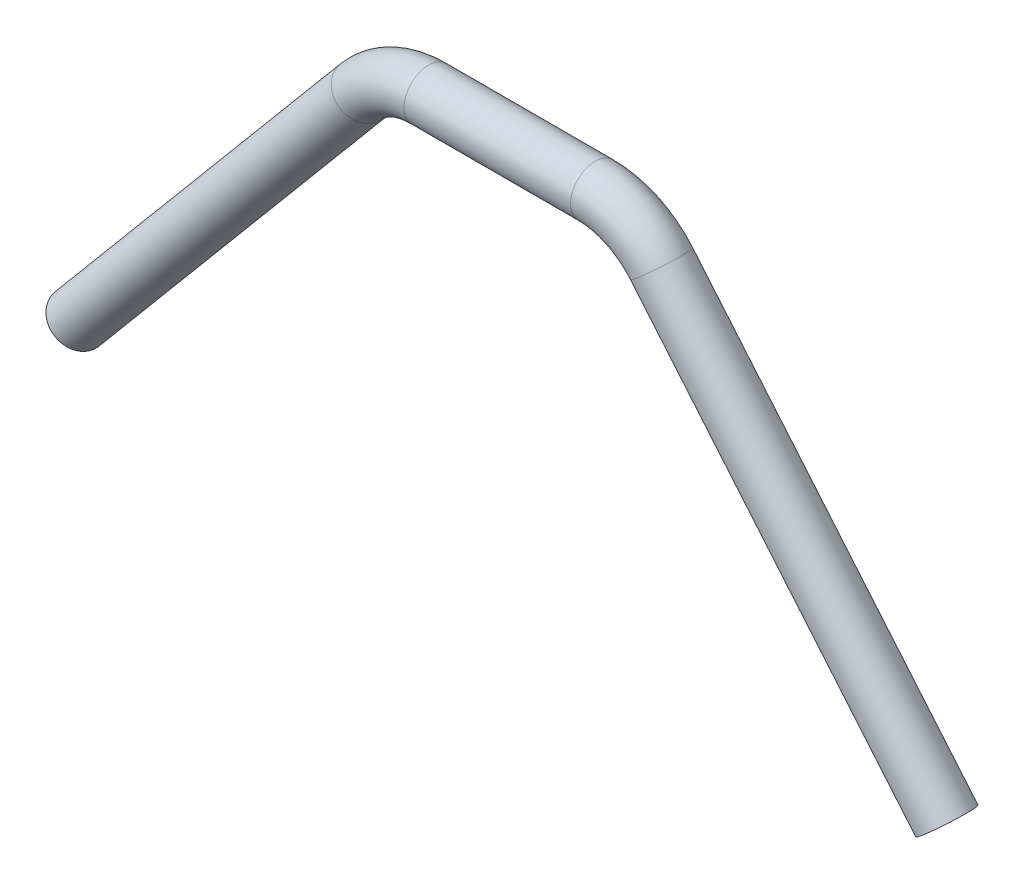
ISO-10303-21;
HEADER;
FILE_DESCRIPTION(('STEP AP214'),'2;1');
FILE_NAME('part.step','',(''),(''),'','','');
FILE_SCHEMA(('AUTOMOTIVE_DESIGN { 1 0 10303 214 1 1 1 1 }'));
ENDSEC;
DATA;
#1=APPLICATION_CONTEXT('core data for automotive mechanical design processes');
#2=APPLICATION_PROTOCOL_DEFINITION('international standard','automotive_design',2000,#1);
#3=PRODUCT_CONTEXT('',#1,'mechanical');
#4=PRODUCT('Part','Part','',(#3));
#5=PRODUCT_RELATED_PRODUCT_CATEGORY('part','',(#4));
#6=PRODUCT_DEFINITION_FORMATION('','',#4);
#7=PRODUCT_DEFINITION_CONTEXT('part definition',#1,'design');
#8=PRODUCT_DEFINITION('design','',#6,#7);
#9=PRODUCT_DEFINITION_SHAPE('','',#8);
#10=(LENGTH_UNIT() NAMED_UNIT(*) SI_UNIT(.MILLI.,.METRE.));
#11=(NAMED_UNIT(*) PLANE_ANGLE_UNIT() SI_UNIT($,.RADIAN.));
#12=(NAMED_UNIT(*) SI_UNIT($,.STERADIAN.) SOLID_ANGLE_UNIT());
#13=UNCERTAINTY_MEASURE_WITH_UNIT(LENGTH_MEASURE(1.E-05),#10,'distance_accuracy_value','');
#14=(GEOMETRIC_REPRESENTATION_CONTEXT(3) GLOBAL_UNCERTAINTY_ASSIGNED_CONTEXT((#13)) GLOBAL_UNIT_ASSIGNED_CONTEXT((#10,
#11,#12)) REPRESENTATION_CONTEXT('',''));
#15=CARTESIAN_POINT('',(0.,0.,0.));
#16=DIRECTION('',(0.,0.,1.));
#17=DIRECTION('',(1.,0.,0.));
#18=AXIS2_PLACEMENT_3D('',#15,#16,#17);
#19=CARTESIAN_POINT('',(-60.4907874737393,-12.5024336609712,0.));
#20=DIRECTION('',(-0.642787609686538,-0.766044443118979,0.));
#21=DIRECTION('',(0.766044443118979,-0.642787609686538,0.));
#22=AXIS2_PLACEMENT_3D('',#19,#20,#21);
#23=CYLINDRICAL_SURFACE('',#22,10.);
#24=CARTESIAN_POINT('',(-60.4907874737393,-12.5024336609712,0.));
#25=DIRECTION('',(0.642787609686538,0.766044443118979,0.));
#26=DIRECTION('',(0.,0.,-1.));
#27=AXIS2_PLACEMENT_3D('',#24,#25,#26);
#28=CIRCLE('',#27,10.);
#29=CARTESIAN_POINT('',(-68.1512319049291,-6.07455756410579,0.));
#30=VERTEX_POINT('',#29);
#31=EDGE_CURVE('E38',#30,#30,#28,.T.);
#32=ORIENTED_EDGE('',*,*,#31,.F.);
#33=EDGE_LOOP('',(#32));
#34=FACE_BOUND('',#33,.T.);
#35=CARTESIAN_POINT('',(-175.864944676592,-150.,0.));
#36=DIRECTION('',(0.642787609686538,0.766044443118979,0.));
#37=DIRECTION('',(0.,0.,-1.));
#38=AXIS2_PLACEMENT_3D('',#35,#36,#37);
#39=CIRCLE('',#38,10.);
#40=CARTESIAN_POINT('',(-175.864944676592,-150.,-10.));
#41=VERTEX_POINT('',#40);
#42=EDGE_CURVE('E10',#41,#41,#39,.T.);
#43=ORIENTED_EDGE('',*,*,#42,.T.);
#44=EDGE_LOOP('',(#43));
#45=FACE_BOUND('',#44,.T.);
#46=ADVANCED_FACE('F28',(#34,#45),#23,.T.);
#47=CARTESIAN_POINT('',(-60.4907874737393,-12.5024336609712,0.));
#48=DIRECTION('',(-0.642787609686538,-0.766044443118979,0.));
#49=DIRECTION('',(0.766044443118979,-0.642787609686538,0.));
#50=AXIS2_PLACEMENT_3D('',#47,#48,#49);
#51=CYLINDRICAL_SURFACE('',#50,8.5);
#52=CARTESIAN_POINT('',(-60.4907874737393,-12.5024336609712,0.));
#53=DIRECTION('',(0.642787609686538,0.766044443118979,0.));
#54=DIRECTION('',(0.,0.,-1.));
#55=AXIS2_PLACEMENT_3D('',#52,#53,#54);
#56=CIRCLE('',#55,8.5);
#57=CARTESIAN_POINT('',(-67.0021652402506,-7.0387389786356,0.));
#58=VERTEX_POINT('',#57);
#59=EDGE_CURVE('E42',#58,#58,#56,.T.);
#60=ORIENTED_EDGE('',*,*,#59,.T.);
#61=EDGE_LOOP('',(#60));
#62=FACE_BOUND('',#61,.T.);
#63=CARTESIAN_POINT('',(-175.864944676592,-150.,0.));
#64=DIRECTION('',(0.642787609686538,0.766044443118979,0.));
#65=DIRECTION('',(0.,0.,-1.));
#66=AXIS2_PLACEMENT_3D('',#63,#64,#65);
#67=CIRCLE('',#66,8.5);
#68=CARTESIAN_POINT('',(-175.864944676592,-150.,-8.5));
#69=VERTEX_POINT('',#68);
#70=EDGE_CURVE('E34',#69,#69,#67,.T.);
#71=ORIENTED_EDGE('',*,*,#70,.F.);
#72=EDGE_LOOP('',(#71));
#73=FACE_BOUND('',#72,.T.);
#74=ADVANCED_FACE('F104',(#62,#73),#51,.F.);
#75=CARTESIAN_POINT('',(-33.679231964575,-35.,0.));
#76=DIRECTION('',(0.,0.,1.));
#77=DIRECTION('',(1.,0.,0.));
#78=AXIS2_PLACEMENT_3D('',#75,#76,#77);
#79=TOROIDAL_SURFACE('',#78,35.,10.);
#80=CARTESIAN_POINT('',(-33.679231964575,0.,0.));
#81=DIRECTION('',(1.,0.,0.));
#82=DIRECTION('',(0.,0.,-1.));
#83=AXIS2_PLACEMENT_3D('',#80,#81,#82);
#84=CIRCLE('',#83,10.);
#85=CARTESIAN_POINT('',(-33.679231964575,10.,0.));
#86=VERTEX_POINT('',#85);
#87=EDGE_CURVE('E47',#86,#86,#84,.T.);
#88=CARTESIAN_POINT('',(-33.679231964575,-35.,0.));
#89=DIRECTION('',(0.,0.,1.));
#90=DIRECTION('',(1.,0.,0.));
#91=AXIS2_PLACEMENT_3D('',#88,#89,#90);
#92=CIRCLE('',#91,45.);
#93=EDGE_CURVE('',#86,#30,#92,.T.);
#94=ORIENTED_EDGE('',*,*,#87,.F.);
#95=ORIENTED_EDGE('',*,*,#31,.T.);
#96=ORIENTED_EDGE('',*,*,#93,.T.);
#97=ORIENTED_EDGE('',*,*,#93,.F.);
#98=EDGE_LOOP('',(#94,#96,#95,#97));
#99=FACE_BOUND('',#98,.T.);
#100=ADVANCED_FACE('F109',(#99),#79,.T.);
#101=CARTESIAN_POINT('',(-33.679231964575,-35.,0.));
#102=DIRECTION('',(0.,0.,1.));
#103=DIRECTION('',(1.,0.,0.));
#104=AXIS2_PLACEMENT_3D('',#101,#102,#103);
#105=TOROIDAL_SURFACE('',#104,35.,8.5);
#106=CARTESIAN_POINT('',(-33.679231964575,0.,0.));
#107=DIRECTION('',(1.,0.,0.));
#108=DIRECTION('',(0.,0.,-1.));
#109=AXIS2_PLACEMENT_3D('',#106,#107,#108);
#110=CIRCLE('',#109,8.5);
#111=CARTESIAN_POINT('',(-33.679231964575,8.5,0.));
#112=VERTEX_POINT('',#111);
#113=EDGE_CURVE('E50',#112,#112,#110,.T.);
#114=CARTESIAN_POINT('',(-33.679231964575,-35.,0.));
#115=DIRECTION('',(0.,0.,1.));
#116=DIRECTION('',(1.,0.,0.));
#117=AXIS2_PLACEMENT_3D('',#114,#115,#116);
#118=CIRCLE('',#117,43.5);
#119=EDGE_CURVE('',#112,#58,#118,.T.);
#120=ORIENTED_EDGE('',*,*,#113,.T.);
#121=ORIENTED_EDGE('',*,*,#59,.F.);
#122=ORIENTED_EDGE('',*,*,#119,.T.);
#123=ORIENTED_EDGE('',*,*,#119,.F.);
#124=EDGE_LOOP('',(#120,#122,#121,#123));
#125=FACE_BOUND('',#124,.T.);
#126=ADVANCED_FACE('F114',(#125),#105,.F.);
#127=CARTESIAN_POINT('',(-33.679231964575,0.,0.));
#128=DIRECTION('',(1.,0.,0.));
#129=DIRECTION('',(0.,1.,0.));
#130=AXIS2_PLACEMENT_3D('',#127,#128,#129);
#131=CYLINDRICAL_SURFACE('',#130,8.5);
#132=ORIENTED_EDGE('',*,*,#113,.F.);
#133=EDGE_LOOP('',(#132));
#134=FACE_BOUND('',#133,.T.);
#135=CARTESIAN_POINT('',(33.679231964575,0.,0.));
#136=DIRECTION('',(1.,0.,0.));
#137=DIRECTION('',(0.,0.,-1.));
#138=AXIS2_PLACEMENT_3D('',#135,#136,#137);
#139=CIRCLE('',#138,8.5);
#140=CARTESIAN_POINT('',(33.679231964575,8.5,0.));
#141=VERTEX_POINT('',#140);
#142=EDGE_CURVE('E68',#141,#141,#139,.T.);
#143=ORIENTED_EDGE('',*,*,#142,.T.);
#144=EDGE_LOOP('',(#143));
#145=FACE_BOUND('',#144,.T.);
#146=ADVANCED_FACE('F72',(#134,#145),#131,.F.);
#147=CARTESIAN_POINT('',(-33.679231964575,0.,0.));
#148=DIRECTION('',(1.,0.,0.));
#149=DIRECTION('',(0.,1.,0.));
#150=AXIS2_PLACEMENT_3D('',#147,#148,#149);
#151=CYLINDRICAL_SURFACE('',#150,10.);
#152=ORIENTED_EDGE('',*,*,#87,.T.);
#153=EDGE_LOOP('',(#152));
#154=FACE_BOUND('',#153,.T.);
#155=CARTESIAN_POINT('',(33.679231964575,0.,0.));
#156=DIRECTION('',(1.,0.,0.));
#157=DIRECTION('',(0.,0.,-1.));
#158=AXIS2_PLACEMENT_3D('',#155,#156,#157);
#159=CIRCLE('',#158,10.);
#160=CARTESIAN_POINT('',(33.679231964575,10.,0.));
#161=VERTEX_POINT('',#160);
#162=EDGE_CURVE('E65',#161,#161,#159,.T.);
#163=ORIENTED_EDGE('',*,*,#162,.F.);
#164=EDGE_LOOP('',(#163));
#165=FACE_BOUND('',#164,.T.);
#166=ADVANCED_FACE('F101',(#154,#165),#151,.T.);
#167=CARTESIAN_POINT('',(-175.864944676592,-150.,0.));
#168=DIRECTION('',(0.642787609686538,0.766044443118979,0.));
#169=DIRECTION('',(0.,0.,-1.));
#170=AXIS2_PLACEMENT_3D('',#167,#168,#169);
#171=PLANE('',#170);
#172=ORIENTED_EDGE('',*,*,#70,.T.);
#173=EDGE_LOOP('',(#172));
#174=FACE_BOUND('',#173,.T.);
#175=ORIENTED_EDGE('',*,*,#42,.F.);
#176=EDGE_LOOP('',(#175));
#177=FACE_BOUND('',#176,.T.);
#178=ADVANCED_FACE('F95',(#174,#177),#171,.F.);
#179=CARTESIAN_POINT('',(60.4907874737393,-12.5024336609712,0.));
#180=DIRECTION('',(0.642787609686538,-0.766044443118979,0.));
#181=DIRECTION('',(0.766044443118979,0.642787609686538,0.));
#182=AXIS2_PLACEMENT_3D('',#179,#180,#181);
#183=CYLINDRICAL_SURFACE('',#182,10.);
#184=CARTESIAN_POINT('',(60.4907874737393,-12.5024336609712,0.));
#185=DIRECTION('',(0.642787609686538,-0.766044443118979,0.));
#186=DIRECTION('',(0.,0.,-1.));
#187=AXIS2_PLACEMENT_3D('',#184,#185,#186);
#188=CIRCLE('',#187,10.);
#189=CARTESIAN_POINT('',(68.1512319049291,-6.07455756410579,0.));
#190=VERTEX_POINT('',#189);
#191=EDGE_CURVE('E59',#190,#190,#188,.T.);
#192=ORIENTED_EDGE('',*,*,#191,.T.);
#193=EDGE_LOOP('',(#192));
#194=FACE_BOUND('',#193,.T.);
#195=CARTESIAN_POINT('',(175.864944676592,-150.,0.));
#196=DIRECTION('',(0.642787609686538,-0.766044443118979,0.));
#197=DIRECTION('',(0.,0.,-1.));
#198=AXIS2_PLACEMENT_3D('',#195,#196,#197);
#199=CIRCLE('',#198,10.);
#200=CARTESIAN_POINT('',(175.864944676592,-150.,-10.));
#201=VERTEX_POINT('',#200);
#202=EDGE_CURVE('E53',#201,#201,#199,.T.);
#203=ORIENTED_EDGE('',*,*,#202,.F.);
#204=EDGE_LOOP('',(#203));
#205=FACE_BOUND('',#204,.T.);
#206=ADVANCED_FACE('F85',(#194,#205),#183,.T.);
#207=CARTESIAN_POINT('',(60.4907874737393,-12.5024336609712,0.));
#208=DIRECTION('',(0.642787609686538,-0.766044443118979,0.));
#209=DIRECTION('',(0.766044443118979,0.642787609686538,0.));
#210=AXIS2_PLACEMENT_3D('',#207,#208,#209);
#211=CYLINDRICAL_SURFACE('',#210,8.5);
#212=CARTESIAN_POINT('',(60.4907874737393,-12.5024336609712,0.));
#213=DIRECTION('',(0.642787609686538,-0.766044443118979,0.));
#214=DIRECTION('',(0.,0.,-1.));
#215=AXIS2_PLACEMENT_3D('',#212,#213,#214);
#216=CIRCLE('',#215,8.5);
#217=CARTESIAN_POINT('',(67.0021652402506,-7.0387389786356,0.));
#218=VERTEX_POINT('',#217);
#219=EDGE_CURVE('E62',#218,#218,#216,.T.);
#220=ORIENTED_EDGE('',*,*,#219,.F.);
#221=EDGE_LOOP('',(#220));
#222=FACE_BOUND('',#221,.T.);
#223=CARTESIAN_POINT('',(175.864944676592,-150.,0.));
#224=DIRECTION('',(0.642787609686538,-0.766044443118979,0.));
#225=DIRECTION('',(0.,0.,-1.));
#226=AXIS2_PLACEMENT_3D('',#223,#224,#225);
#227=CIRCLE('',#226,8.5);
#228=CARTESIAN_POINT('',(175.864944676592,-150.,-8.5));
#229=VERTEX_POINT('',#228);
#230=EDGE_CURVE('E56',#229,#229,#227,.T.);
#231=ORIENTED_EDGE('',*,*,#230,.T.);
#232=EDGE_LOOP('',(#231));
#233=FACE_BOUND('',#232,.T.);
#234=ADVANCED_FACE('F82',(#222,#233),#211,.F.);
#235=CARTESIAN_POINT('',(33.679231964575,-35.,0.));
#236=DIRECTION('',(0.,0.,-1.));
#237=DIRECTION('',(-1.,0.,0.));
#238=AXIS2_PLACEMENT_3D('',#235,#236,#237);
#239=TOROIDAL_SURFACE('',#238,35.,10.);
#240=CARTESIAN_POINT('',(33.679231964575,-35.,0.));
#241=DIRECTION('',(0.,0.,-1.));
#242=DIRECTION('',(-1.,0.,0.));
#243=AXIS2_PLACEMENT_3D('',#240,#241,#242);
#244=CIRCLE('',#243,45.);
#245=EDGE_CURVE('',#161,#190,#244,.T.);
#246=ORIENTED_EDGE('',*,*,#162,.T.);
#247=ORIENTED_EDGE('',*,*,#191,.F.);
#248=ORIENTED_EDGE('',*,*,#245,.T.);
#249=ORIENTED_EDGE('',*,*,#245,.F.);
#250=EDGE_LOOP('',(#246,#248,#247,#249));
#251=FACE_BOUND('',#250,.T.);
#252=ADVANCED_FACE('F78',(#251),#239,.T.);
#253=CARTESIAN_POINT('',(33.679231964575,-35.,0.));
#254=DIRECTION('',(0.,0.,-1.));
#255=DIRECTION('',(-1.,0.,0.));
#256=AXIS2_PLACEMENT_3D('',#253,#254,#255);
#257=TOROIDAL_SURFACE('',#256,35.,8.5);
#258=CARTESIAN_POINT('',(33.679231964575,-35.,0.));
#259=DIRECTION('',(0.,0.,-1.));
#260=DIRECTION('',(-1.,0.,0.));
#261=AXIS2_PLACEMENT_3D('',#258,#259,#260);
#262=CIRCLE('',#261,43.5);
#263=EDGE_CURVE('',#141,#218,#262,.T.);
#264=ORIENTED_EDGE('',*,*,#142,.F.);
#265=ORIENTED_EDGE('',*,*,#219,.T.);
#266=ORIENTED_EDGE('',*,*,#263,.T.);
#267=ORIENTED_EDGE('',*,*,#263,.F.);
#268=EDGE_LOOP('',(#264,#266,#265,#267));
#269=FACE_BOUND('',#268,.T.);
#270=ADVANCED_FACE('F74',(#269),#257,.F.);
#271=CARTESIAN_POINT('',(175.864944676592,-150.,0.));
#272=DIRECTION('',(-0.642787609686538,0.766044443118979,0.));
#273=DIRECTION('',(0.,0.,-1.));
#274=AXIS2_PLACEMENT_3D('',#271,#272,#273);
#275=PLANE('',#274);
#276=ORIENTED_EDGE('',*,*,#230,.F.);
#277=EDGE_LOOP('',(#276));
#278=FACE_BOUND('',#277,.T.);
#279=ORIENTED_EDGE('',*,*,#202,.T.);
#280=EDGE_LOOP('',(#279));
#281=FACE_BOUND('',#280,.T.);
#282=ADVANCED_FACE('F77',(#278,#281),#275,.F.);
#283=CLOSED_SHELL('',(#46,#74,#100,#126,#146,#166,#178,#206,#234,#252,#270,#282));
#284=MANIFOLD_SOLID_BREP('B2',#283);
#285=ADVANCED_BREP_SHAPE_REPRESENTATION('',(#18,#284),#14);
#286=SHAPE_DEFINITION_REPRESENTATION(#9,#285);
ENDSEC;
END-ISO-10303-21;
